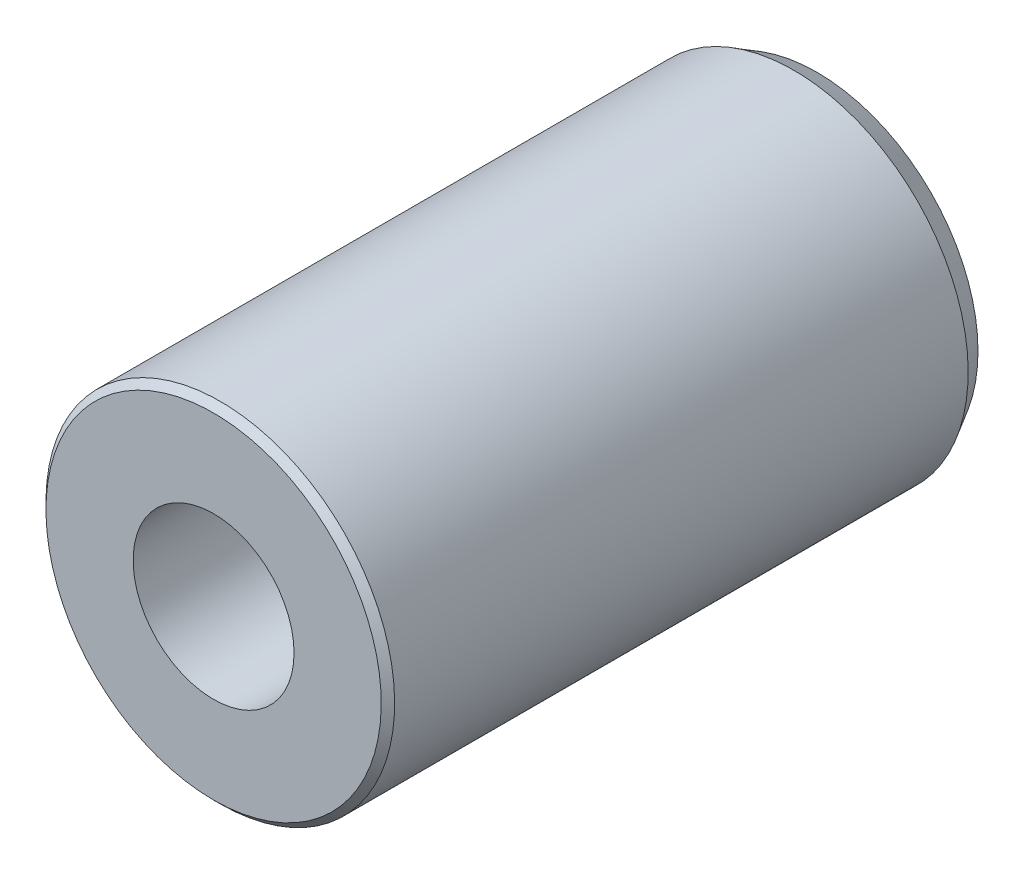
ISO-10303-21;
HEADER;
FILE_DESCRIPTION(('STEP AP214'),'2;1');
FILE_NAME('part.step','',(''),(''),'','','');
FILE_SCHEMA(('AUTOMOTIVE_DESIGN { 1 0 10303 214 1 1 1 1 }'));
ENDSEC;
DATA;
#1=APPLICATION_CONTEXT('core data for automotive mechanical design processes');
#2=APPLICATION_PROTOCOL_DEFINITION('international standard','automotive_design',2000,#1);
#3=PRODUCT_CONTEXT('',#1,'mechanical');
#4=PRODUCT('Part','Part','',(#3));
#5=PRODUCT_RELATED_PRODUCT_CATEGORY('part','',(#4));
#6=PRODUCT_DEFINITION_FORMATION('','',#4);
#7=PRODUCT_DEFINITION_CONTEXT('part definition',#1,'design');
#8=PRODUCT_DEFINITION('design','',#6,#7);
#9=PRODUCT_DEFINITION_SHAPE('','',#8);
#10=(LENGTH_UNIT() NAMED_UNIT(*) SI_UNIT(.MILLI.,.METRE.));
#11=(NAMED_UNIT(*) PLANE_ANGLE_UNIT() SI_UNIT($,.RADIAN.));
#12=(NAMED_UNIT(*) SI_UNIT($,.STERADIAN.) SOLID_ANGLE_UNIT());
#13=UNCERTAINTY_MEASURE_WITH_UNIT(LENGTH_MEASURE(1.E-05),#10,'distance_accuracy_value','');
#14=(GEOMETRIC_REPRESENTATION_CONTEXT(3) GLOBAL_UNCERTAINTY_ASSIGNED_CONTEXT((#13)) GLOBAL_UNIT_ASSIGNED_CONTEXT((#10,
#11,#12)) REPRESENTATION_CONTEXT('',''));
#15=CARTESIAN_POINT('',(0.,0.,0.));
#16=DIRECTION('',(0.,0.,1.));
#17=DIRECTION('',(1.,0.,0.));
#18=AXIS2_PLACEMENT_3D('',#15,#16,#17);
#19=CARTESIAN_POINT('',(0.,0.,45.));
#20=DIRECTION('',(0.,0.,1.));
#21=DIRECTION('',(0.,-1.,0.));
#22=AXIS2_PLACEMENT_3D('',#19,#20,#21);
#23=PLANE('',#22);
#24=CARTESIAN_POINT('',(0.,0.,45.));
#25=DIRECTION('',(0.,0.,1.));
#26=DIRECTION('',(0.,-1.,0.));
#27=AXIS2_PLACEMENT_3D('',#24,#25,#26);
#28=CIRCLE('',#27,12.5);
#29=CARTESIAN_POINT('',(0.,-12.5,45.));
#30=VERTEX_POINT('',#29);
#31=EDGE_CURVE('E27',#30,#30,#28,.T.);
#32=ORIENTED_EDGE('',*,*,#31,.T.);
#33=EDGE_LOOP('',(#32));
#34=FACE_BOUND('',#33,.T.);
#35=CARTESIAN_POINT('',(0.,0.,45.));
#36=DIRECTION('',(0.,0.,1.));
#37=DIRECTION('',(1.,0.,0.));
#38=AXIS2_PLACEMENT_3D('',#35,#36,#37);
#39=CIRCLE('',#38,6.);
#40=CARTESIAN_POINT('',(6.,0.,45.));
#41=VERTEX_POINT('',#40);
#42=EDGE_CURVE('E35',#41,#41,#39,.T.);
#43=ORIENTED_EDGE('',*,*,#42,.F.);
#44=EDGE_LOOP('',(#43));
#45=FACE_BOUND('',#44,.T.);
#46=ADVANCED_FACE('F12',(#34,#45),#23,.T.);
#47=CARTESIAN_POINT('',(0.,0.,0.));
#48=DIRECTION('',(0.,0.,1.));
#49=DIRECTION('',(0.,-1.,0.));
#50=AXIS2_PLACEMENT_3D('',#47,#48,#49);
#51=PLANE('',#50);
#52=CARTESIAN_POINT('',(0.,0.,0.));
#53=DIRECTION('',(0.,0.,1.));
#54=DIRECTION('',(0.,-1.,0.));
#55=AXIS2_PLACEMENT_3D('',#52,#53,#54);
#56=CIRCLE('',#55,12.);
#57=CARTESIAN_POINT('',(0.,-12.,0.));
#58=VERTEX_POINT('',#57);
#59=EDGE_CURVE('E8',#58,#58,#56,.F.);
#60=ORIENTED_EDGE('',*,*,#59,.T.);
#61=EDGE_LOOP('',(#60));
#62=FACE_BOUND('',#61,.T.);
#63=CARTESIAN_POINT('',(0.,0.,0.));
#64=DIRECTION('',(0.,0.,1.));
#65=DIRECTION('',(0.,-1.,0.));
#66=AXIS2_PLACEMENT_3D('',#63,#64,#65);
#67=CIRCLE('',#66,6.);
#68=CARTESIAN_POINT('',(0.,-6.,0.));
#69=VERTEX_POINT('',#68);
#70=EDGE_CURVE('E32',#69,#69,#67,.F.);
#71=ORIENTED_EDGE('',*,*,#70,.F.);
#72=EDGE_LOOP('',(#71));
#73=FACE_BOUND('',#72,.T.);
#74=ADVANCED_FACE('F43',(#62,#73),#51,.F.);
#75=CARTESIAN_POINT('',(0.,0.,45.));
#76=DIRECTION('',(0.,0.,-1.));
#77=DIRECTION('',(0.,1.,0.));
#78=AXIS2_PLACEMENT_3D('',#75,#76,#77);
#79=CYLINDRICAL_SURFACE('',#78,13.);
#80=CARTESIAN_POINT('',(0.,0.,1.73205080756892));
#81=DIRECTION('',(0.,0.,1.));
#82=DIRECTION('',(0.,-1.,0.));
#83=AXIS2_PLACEMENT_3D('',#80,#81,#82);
#84=CIRCLE('',#83,13.);
#85=CARTESIAN_POINT('',(0.,-13.,1.73205080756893));
#86=VERTEX_POINT('',#85);
#87=EDGE_CURVE('E19',#86,#86,#84,.T.);
#88=ORIENTED_EDGE('',*,*,#87,.T.);
#89=EDGE_LOOP('',(#88));
#90=FACE_BOUND('',#89,.T.);
#91=CARTESIAN_POINT('',(0.,0.,44.5));
#92=DIRECTION('',(0.,0.,1.));
#93=DIRECTION('',(0.,-1.,0.));
#94=AXIS2_PLACEMENT_3D('',#91,#92,#93);
#95=CIRCLE('',#94,13.);
#96=CARTESIAN_POINT('',(0.,-13.,44.5));
#97=VERTEX_POINT('',#96);
#98=EDGE_CURVE('E23',#97,#97,#95,.F.);
#99=ORIENTED_EDGE('',*,*,#98,.T.);
#100=EDGE_LOOP('',(#99));
#101=FACE_BOUND('',#100,.T.);
#102=ADVANCED_FACE('F14',(#90,#101),#79,.T.);
#103=CARTESIAN_POINT('',(0.,0.,45.));
#104=DIRECTION('',(0.,0.,1.));
#105=DIRECTION('',(1.,0.,0.));
#106=AXIS2_PLACEMENT_3D('',#103,#104,#105);
#107=CYLINDRICAL_SURFACE('',#106,6.);
#108=ORIENTED_EDGE('',*,*,#42,.T.);
#109=EDGE_LOOP('',(#108));
#110=FACE_BOUND('',#109,.T.);
#111=ORIENTED_EDGE('',*,*,#70,.T.);
#112=EDGE_LOOP('',(#111));
#113=FACE_BOUND('',#112,.T.);
#114=ADVANCED_FACE('F39',(#110,#113),#107,.F.);
#115=CARTESIAN_POINT('',(0.,0.,45.));
#116=DIRECTION('',(0.,0.,-1.));
#117=DIRECTION('',(0.,1.,0.));
#118=AXIS2_PLACEMENT_3D('',#115,#116,#117);
#119=CONICAL_SURFACE('',#118,12.5,0.785398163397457);
#120=ORIENTED_EDGE('',*,*,#98,.F.);
#121=EDGE_LOOP('',(#120));
#122=FACE_BOUND('',#121,.T.);
#123=ORIENTED_EDGE('',*,*,#31,.F.);
#124=EDGE_LOOP('',(#123));
#125=FACE_BOUND('',#124,.T.);
#126=ADVANCED_FACE('F54',(#122,#125),#119,.T.);
#127=CARTESIAN_POINT('',(0.,0.,1.73205080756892));
#128=DIRECTION('',(0.,0.,1.));
#129=DIRECTION('',(0.,-1.,0.));
#130=AXIS2_PLACEMENT_3D('',#127,#128,#129);
#131=CONICAL_SURFACE('',#130,13.,0.523598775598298);
#132=ORIENTED_EDGE('',*,*,#59,.F.);
#133=EDGE_LOOP('',(#132));
#134=FACE_BOUND('',#133,.T.);
#135=ORIENTED_EDGE('',*,*,#87,.F.);
#136=EDGE_LOOP('',(#135));
#137=FACE_BOUND('',#136,.T.);
#138=ADVANCED_FACE('F57',(#134,#137),#131,.T.);
#139=CLOSED_SHELL('',(#46,#74,#102,#114,#126,#138));
#140=MANIFOLD_SOLID_BREP('B1',#139);
#141=ADVANCED_BREP_SHAPE_REPRESENTATION('',(#18,#140),#14);
#142=SHAPE_DEFINITION_REPRESENTATION(#9,#141);
ENDSEC;
END-ISO-10303-21;
